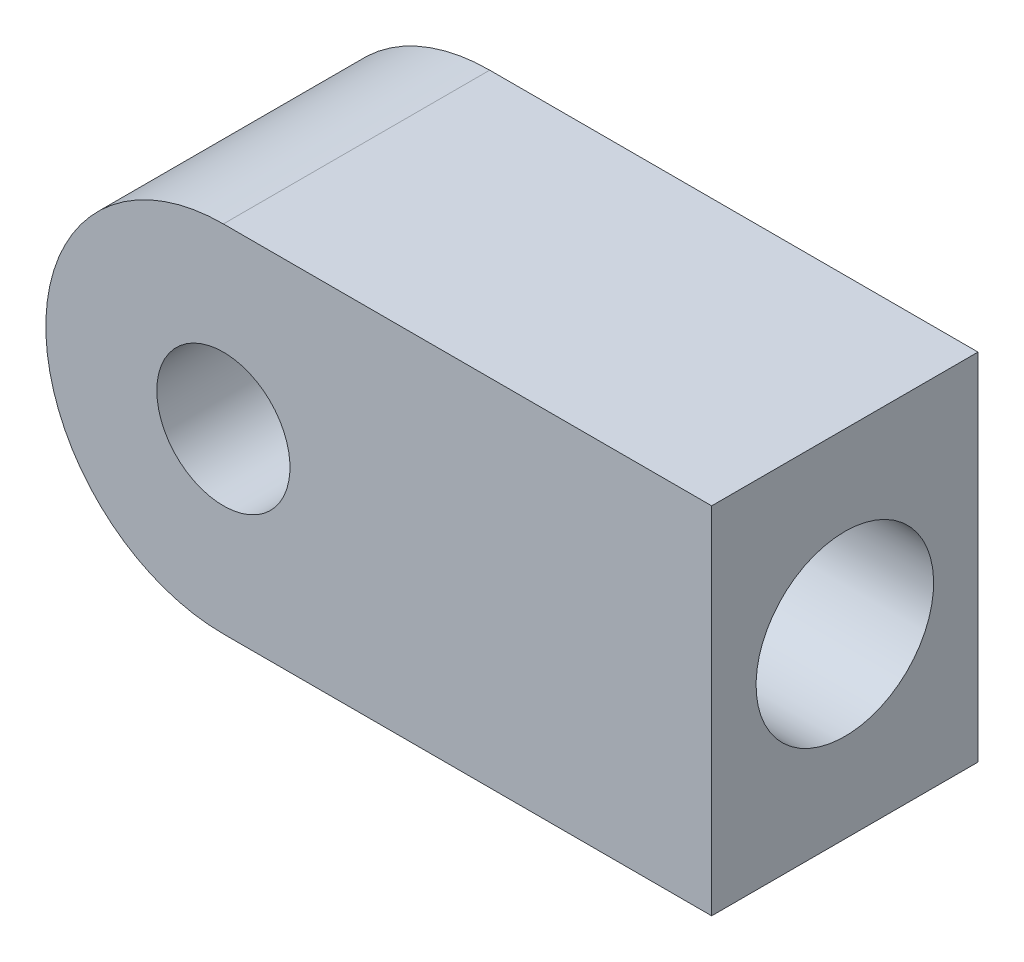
from build123d import *

# Parameters (mm, degrees)
SKETCH3_R          = 9.525
BASE_EXTRUDE_DEPTH = 19.05
SKETCH4_R          = 12.7
CUT_EXTRUDE1_DEPTH = 38.1


with BuildPart() as part:
    # Sketch3 → Base-Extrude (new, symmetric)
    with BuildSketch(Plane.XY):
        with BuildLine():
            Line((-69.85, 25.4), (0, 25.4))
            Line((0, 25.4), (0, -25.4))
            Line((0, -25.4), (-69.85, -25.4))
            ThreePointArc((-69.85, -25.4), (-95.25, 0), (-69.85, 25.4))
        make_face()
        with Locations(Location((-69.85, 0, 0), (0, 0, 180))):
            Circle(SKETCH3_R, mode=Mode.SUBTRACT)
    extrude(amount=BASE_EXTRUDE_DEPTH, both=True)

    # Sketch4 → Cut-Extrude1 (cut)
    with BuildSketch(Plane(origin=(0, 0, 0), x_dir=(0, 0, -1), z_dir=(1, 0, 0))):
        with Locations(Location((0, 0, 0), (0, 0, 90))):
            Circle(SKETCH4_R)
    extrude(amount=-CUT_EXTRUDE1_DEPTH, mode=Mode.SUBTRACT)


solid = part.part
